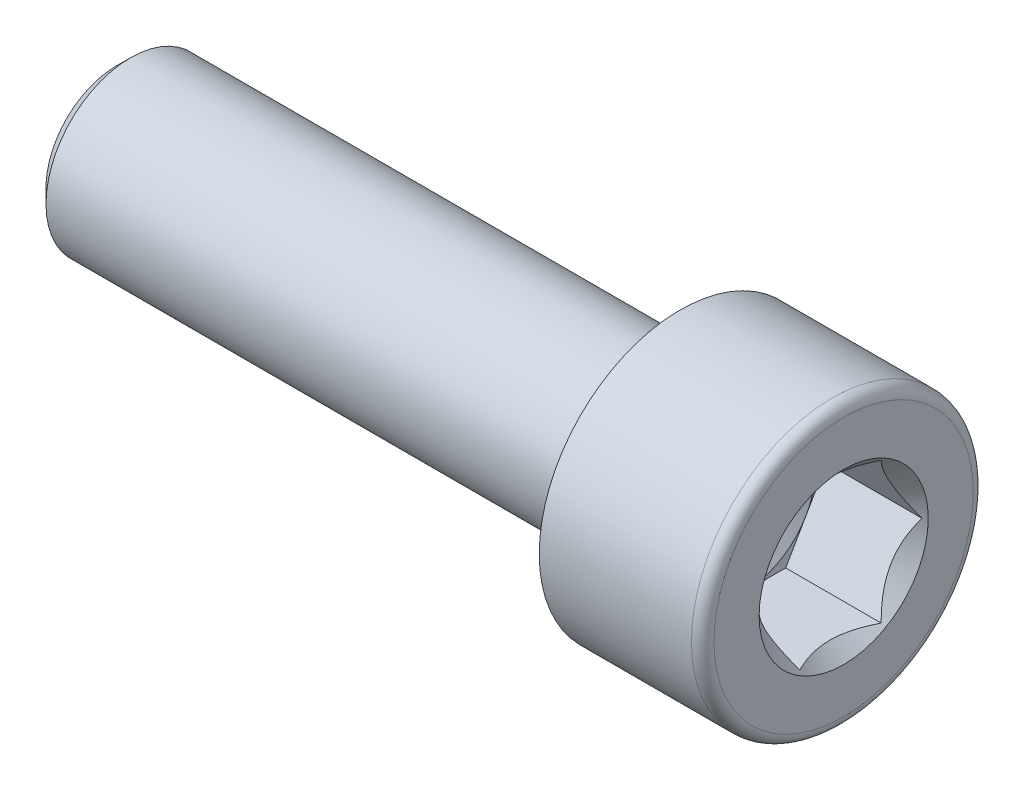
from build123d import *

# Parameters (mm, degrees)
CHANFREIN1_SIZE         = 0.5
ENL_V_MAT_EXTRU_1_DEPTH = 3.5


with BuildPart() as part:
    # Esquisse1 → Base-R_volution (revolve)
    with BuildSketch(Plane.XY, mode=Mode.PRIVATE) as base_r_volution_sk:
        with BuildLine():
            Line((0, 3), (0, 5))
            Line((0, 5), (5.4, 5))
            ThreePointArc((5.4, 5), (5.682842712, 4.882842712), (5.8, 4.6))
            Line((5.8, 4.6), (5.8, 3))
            Line((5.8, 3), (5.3, 2.5))
            Line((5.3, 2.5), (2.3, 2.5))
            Line((2.3, 2.5), (0.856624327, 0))
            Line((0.856624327, 0), (-20, 0))
            Line((-20, 0), (-20, 3))
            Line((-20, 3), (0, 3))
        make_face()
    revolve(base_r_volution_sk.sketch.rotate(Axis((-30, 0, 0), (1, 0, 0)), 90), axis=Axis((-30, 0, 0), (1, 0, 0)))

    # Chanfrein1
    chanfrein1_edges = [part.edges().sort_by_distance(p)[0] for p in [
        (-20, 0, -3),
    ]]
    chamfer(chanfrein1_edges, length=CHANFREIN1_SIZE)

    # Esquisse2 → Enl_v. mat.-Extru.1 (cut)
    with BuildSketch(Plane(origin=(5.8, 0, 0), x_dir=(0, 0, -1), z_dir=(1, 0, 0))):
        Polygon((-2.886751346, 0), (-1.443375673, -2.5), (1.443375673, -2.5), (2.886751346, 0), (1.443375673, 2.5), (-1.443375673, 2.5), align=None)
    extrude(amount=-ENL_V_MAT_EXTRU_1_DEPTH, mode=Mode.SUBTRACT)


solid = part.part
